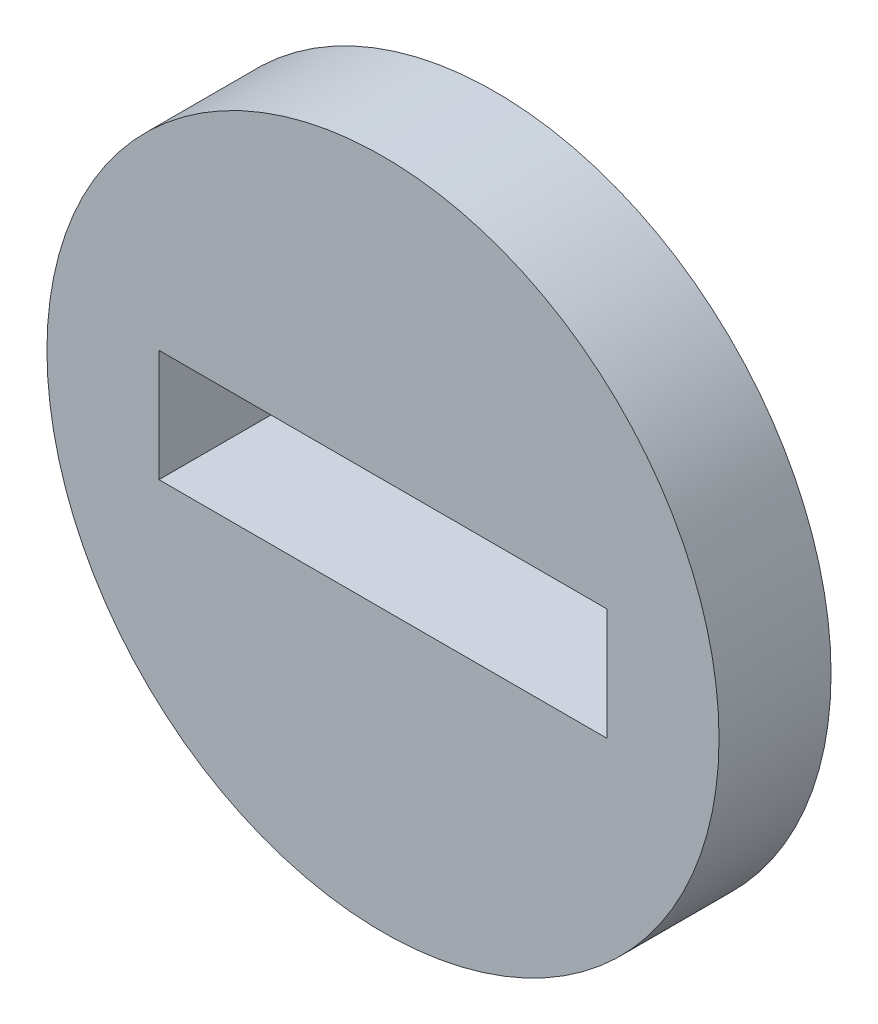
from build123d import *

# Parameters (mm, degrees)
SKETCH1_R          = 19.05
EXTRUDE1_DEPTH     = 6.35
SKETCH2_W          = 25.4
SKETCH2_H          = 6.35
CUT_EXTRUDE1_DEPTH = 28.679008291


with BuildPart() as part:
    # Sketch1 → Extrude1 (new body)
    with BuildSketch(Plane.XY):
        Circle(SKETCH1_R)
    extrude(amount=EXTRUDE1_DEPTH)

    # Sketch2 → Cut-Extrude1 (cut, through all)
    with BuildSketch(Plane.XY.offset(6.35)):
        Rectangle(SKETCH2_W, SKETCH2_H)
    extrude(amount=-CUT_EXTRUDE1_DEPTH, mode=Mode.SUBTRACT)


solid = part.part
